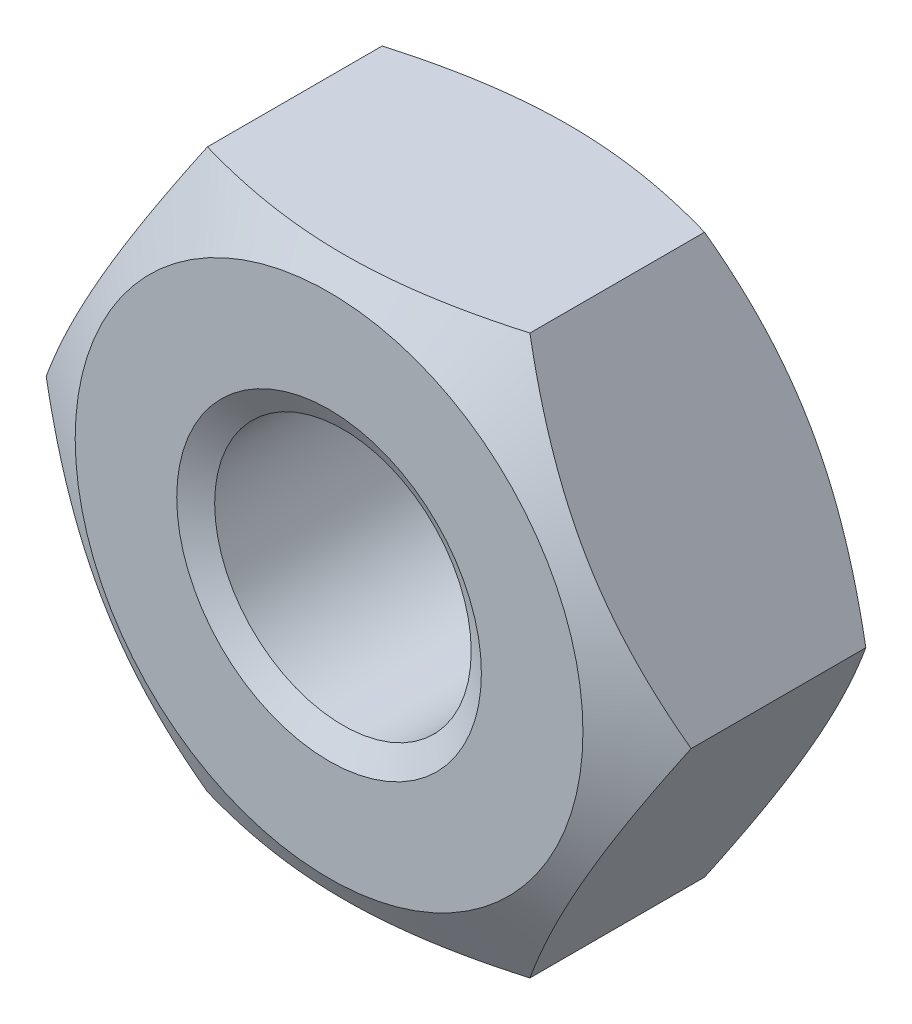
ISO-10303-21;
HEADER;
FILE_DESCRIPTION(('STEP AP214'),'2;1');
FILE_NAME('part.step','',(''),(''),'','','');
FILE_SCHEMA(('AUTOMOTIVE_DESIGN { 1 0 10303 214 1 1 1 1 }'));
ENDSEC;
DATA;
#1=APPLICATION_CONTEXT('core data for automotive mechanical design processes');
#2=APPLICATION_PROTOCOL_DEFINITION('international standard','automotive_design',2000,#1);
#3=PRODUCT_CONTEXT('',#1,'mechanical');
#4=PRODUCT('Part','Part','',(#3));
#5=PRODUCT_RELATED_PRODUCT_CATEGORY('part','',(#4));
#6=PRODUCT_DEFINITION_FORMATION('','',#4);
#7=PRODUCT_DEFINITION_CONTEXT('part definition',#1,'design');
#8=PRODUCT_DEFINITION('design','',#6,#7);
#9=PRODUCT_DEFINITION_SHAPE('','',#8);
#10=(LENGTH_UNIT() NAMED_UNIT(*) SI_UNIT(.MILLI.,.METRE.));
#11=(NAMED_UNIT(*) PLANE_ANGLE_UNIT() SI_UNIT($,.RADIAN.));
#12=(NAMED_UNIT(*) SI_UNIT($,.STERADIAN.) SOLID_ANGLE_UNIT());
#13=UNCERTAINTY_MEASURE_WITH_UNIT(LENGTH_MEASURE(1.E-05),#10,'distance_accuracy_value','');
#14=(GEOMETRIC_REPRESENTATION_CONTEXT(3) GLOBAL_UNCERTAINTY_ASSIGNED_CONTEXT((#13)) GLOBAL_UNIT_ASSIGNED_CONTEXT((#10,
#11,#12)) REPRESENTATION_CONTEXT('',''));
#15=CARTESIAN_POINT('',(0.,0.,0.));
#16=DIRECTION('',(0.,0.,1.));
#17=DIRECTION('',(1.,0.,0.));
#18=AXIS2_PLACEMENT_3D('',#15,#16,#17);
#19=CARTESIAN_POINT('',(0.,0.,0.273429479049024));
#20=DIRECTION('',(0.,0.,-1.));
#21=DIRECTION('',(1.,0.,0.));
#22=AXIS2_PLACEMENT_3D('',#19,#20,#21);
#23=CONICAL_SURFACE('',#22,5.52640625,1.0471975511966);
#24=CARTESIAN_POINT('',(0.,0.,0.546858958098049));
#25=DIRECTION('',(0.,0.,1.));
#26=DIRECTION('',(1.,0.,0.));
#27=AXIS2_PLACEMENT_3D('',#24,#25,#26);
#28=CIRCLE('',#27,5.0528125);
#29=CARTESIAN_POINT('',(5.0528125,0.,0.546858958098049));
#30=VERTEX_POINT('',#29);
#31=EDGE_CURVE('E11',#30,#30,#28,.T.);
#32=ORIENTED_EDGE('',*,*,#31,.T.);
#33=EDGE_LOOP('',(#32));
#34=FACE_BOUND('',#33,.T.);
#35=CARTESIAN_POINT('',(0.,0.,0.));
#36=DIRECTION('',(0.,0.,1.));
#37=DIRECTION('',(1.,0.,0.));
#38=AXIS2_PLACEMENT_3D('',#35,#36,#37);
#39=CIRCLE('',#38,6.);
#40=CARTESIAN_POINT('',(6.,0.,0.));
#41=VERTEX_POINT('',#40);
#42=EDGE_CURVE('E98',#41,#41,#39,.T.);
#43=ORIENTED_EDGE('',*,*,#42,.F.);
#44=EDGE_LOOP('',(#43));
#45=FACE_BOUND('',#44,.T.);
#46=ADVANCED_FACE('F16',(#34,#45),#23,.F.);
#47=CARTESIAN_POINT('',(0.,0.,5.));
#48=DIRECTION('',(0.,0.,-1.));
#49=DIRECTION('',(1.,0.,0.));
#50=AXIS2_PLACEMENT_3D('',#47,#48,#49);
#51=CYLINDRICAL_SURFACE('',#50,5.0528125);
#52=CARTESIAN_POINT('',(0.,0.,9.45314104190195));
#53=DIRECTION('',(0.,0.,1.));
#54=DIRECTION('',(1.,0.,0.));
#55=AXIS2_PLACEMENT_3D('',#52,#53,#54);
#56=CIRCLE('',#55,5.0528125);
#57=CARTESIAN_POINT('',(5.0528125,0.,9.45314104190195));
#58=VERTEX_POINT('',#57);
#59=EDGE_CURVE('E20',#58,#58,#56,.T.);
#60=ORIENTED_EDGE('',*,*,#59,.T.);
#61=EDGE_LOOP('',(#60));
#62=FACE_BOUND('',#61,.T.);
#63=ORIENTED_EDGE('',*,*,#31,.F.);
#64=EDGE_LOOP('',(#63));
#65=FACE_BOUND('',#64,.T.);
#66=ADVANCED_FACE('F234',(#62,#65),#51,.F.);
#67=CARTESIAN_POINT('',(0.,0.,9.72657052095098));
#68=DIRECTION('',(0.,0.,1.));
#69=DIRECTION('',(1.,0.,0.));
#70=AXIS2_PLACEMENT_3D('',#67,#68,#69);
#71=CONICAL_SURFACE('',#70,5.52640625,1.0471975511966);
#72=CARTESIAN_POINT('',(0.,0.,10.));
#73=DIRECTION('',(0.,0.,-1.));
#74=DIRECTION('',(1.,0.,0.));
#75=AXIS2_PLACEMENT_3D('',#72,#73,#74);
#76=CIRCLE('',#75,6.);
#77=CARTESIAN_POINT('',(6.,0.,10.));
#78=VERTEX_POINT('',#77);
#79=EDGE_CURVE('E137',#78,#78,#76,.T.);
#80=ORIENTED_EDGE('',*,*,#79,.F.);
#81=EDGE_LOOP('',(#80));
#82=FACE_BOUND('',#81,.T.);
#83=ORIENTED_EDGE('',*,*,#59,.F.);
#84=EDGE_LOOP('',(#83));
#85=FACE_BOUND('',#84,.T.);
#86=ADVANCED_FACE('F240',(#82,#85),#71,.F.);
#87=CARTESIAN_POINT('',(0.,0.,0.779915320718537));
#88=DIRECTION('',(0.,0.,1.));
#89=DIRECTION('',(1.,0.,0.));
#90=AXIS2_PLACEMENT_3D('',#87,#88,#89);
#91=CONICAL_SURFACE('',#90,11.3508529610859,1.0471975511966);
#92=CARTESIAN_POINT('',(12.7017059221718,0.,1.55983064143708));
#93=CARTESIAN_POINT('',(9.52627944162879,-5.5,-0.273502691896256));
#94=CARTESIAN_POINT('',(6.35085296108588,-11.,1.55983064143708));
#95=(BOUNDED_CURVE() B_SPLINE_CURVE(2,(#92,#93,#94),.UNSPECIFIED.,.F.,
.F.) B_SPLINE_CURVE_WITH_KNOTS((3,3),(0.,12.8527975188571),
.UNSPECIFIED.) CURVE() GEOMETRIC_REPRESENTATION_ITEM() RATIONAL_B_SPLINE_CURVE((1.,
1.15470053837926,1.)) REPRESENTATION_ITEM(''));
#96=CARTESIAN_POINT('',(12.7017059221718,0.,1.55983064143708));
#97=VERTEX_POINT('',#96);
#98=CARTESIAN_POINT('',(6.35085296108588,-11.,1.55983064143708));
#99=VERTEX_POINT('',#98);
#100=EDGE_CURVE('E117',#97,#99,#95,.T.);
#101=ORIENTED_EDGE('',*,*,#100,.T.);
#102=CARTESIAN_POINT('',(6.35085296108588,-11.,1.55983064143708));
#103=CARTESIAN_POINT('',(0.,-11.,-0.273502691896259));
#104=CARTESIAN_POINT('',(-6.35085296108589,-11.,1.55983064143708));
#105=(BOUNDED_CURVE() B_SPLINE_CURVE(2,(#102,#103,#104),.UNSPECIFIED.,.F.,
.F.) B_SPLINE_CURVE_WITH_KNOTS((3,3),(0.,12.8527975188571),
.UNSPECIFIED.) CURVE() GEOMETRIC_REPRESENTATION_ITEM() RATIONAL_B_SPLINE_CURVE((1.,
1.15470053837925,1.)) REPRESENTATION_ITEM(''));
#106=CARTESIAN_POINT('',(-6.35085296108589,-11.,1.55983064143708));
#107=VERTEX_POINT('',#106);
#108=EDGE_CURVE('E109',#99,#107,#105,.T.);
#109=ORIENTED_EDGE('',*,*,#108,.T.);
#110=CARTESIAN_POINT('',(-6.35085296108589,-11.,1.55983064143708));
#111=CARTESIAN_POINT('',(-9.52627944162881,-5.49999999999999,-0.273502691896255));
#112=CARTESIAN_POINT('',(-12.7017059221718,0.,1.55983064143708));
#113=(BOUNDED_CURVE() B_SPLINE_CURVE(2,(#110,#111,#112),.UNSPECIFIED.,.F.,
.F.) B_SPLINE_CURVE_WITH_KNOTS((3,3),(0.,12.8527975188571),
.UNSPECIFIED.) CURVE() GEOMETRIC_REPRESENTATION_ITEM() RATIONAL_B_SPLINE_CURVE((1.,
1.15470053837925,1.)) REPRESENTATION_ITEM(''));
#114=CARTESIAN_POINT('',(-12.7017059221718,0.,1.55983064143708));
#115=VERTEX_POINT('',#114);
#116=EDGE_CURVE('E108',#107,#115,#113,.T.);
#117=ORIENTED_EDGE('',*,*,#116,.T.);
#118=CARTESIAN_POINT('',(-12.7017059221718,0.,1.55983064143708));
#119=CARTESIAN_POINT('',(-9.52627944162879,5.5,-0.273502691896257));
#120=CARTESIAN_POINT('',(-6.35085296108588,11.,1.55983064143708));
#121=(BOUNDED_CURVE() B_SPLINE_CURVE(2,(#118,#119,#120),.UNSPECIFIED.,.F.,
.F.) B_SPLINE_CURVE_WITH_KNOTS((3,3),(0.,12.8527975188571),
.UNSPECIFIED.) CURVE() GEOMETRIC_REPRESENTATION_ITEM() RATIONAL_B_SPLINE_CURVE((1.,
1.15470053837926,1.)) REPRESENTATION_ITEM(''));
#122=CARTESIAN_POINT('',(-6.35085296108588,11.,1.55983064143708));
#123=VERTEX_POINT('',#122);
#124=EDGE_CURVE('E103',#115,#123,#121,.T.);
#125=ORIENTED_EDGE('',*,*,#124,.T.);
#126=CARTESIAN_POINT('',(-6.35085296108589,11.,1.55983064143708));
#127=CARTESIAN_POINT('',(0.,11.,-0.27350269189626));
#128=CARTESIAN_POINT('',(6.35085296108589,11.,1.55983064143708));
#129=(BOUNDED_CURVE() B_SPLINE_CURVE(2,(#126,#127,#128),.UNSPECIFIED.,.F.,
.F.) B_SPLINE_CURVE_WITH_KNOTS((3,3),(0.,12.8527975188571),
.UNSPECIFIED.) CURVE() GEOMETRIC_REPRESENTATION_ITEM() RATIONAL_B_SPLINE_CURVE((1.,
1.15470053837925,1.)) REPRESENTATION_ITEM(''));
#130=CARTESIAN_POINT('',(6.35085296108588,11.,1.55983064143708));
#131=VERTEX_POINT('',#130);
#132=EDGE_CURVE('E85',#123,#131,#129,.T.);
#133=ORIENTED_EDGE('',*,*,#132,.T.);
#134=CARTESIAN_POINT('',(6.35085296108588,11.,1.55983064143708));
#135=CARTESIAN_POINT('',(9.52627944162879,5.5,-0.273502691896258));
#136=CARTESIAN_POINT('',(12.7017059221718,0.,1.55983064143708));
#137=(BOUNDED_CURVE() B_SPLINE_CURVE(2,(#134,#135,#136),.UNSPECIFIED.,.F.,
.F.) B_SPLINE_CURVE_WITH_KNOTS((3,3),(0.,12.8527975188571),
.UNSPECIFIED.) CURVE() GEOMETRIC_REPRESENTATION_ITEM() RATIONAL_B_SPLINE_CURVE((1.,
1.15470053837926,1.)) REPRESENTATION_ITEM(''));
#138=EDGE_CURVE('E82',#131,#97,#137,.T.);
#139=ORIENTED_EDGE('',*,*,#138,.T.);
#140=EDGE_LOOP('',(#101,#109,#117,#125,#133,#139));
#141=FACE_BOUND('',#140,.T.);
#142=CARTESIAN_POINT('',(0.,0.,0.));
#143=DIRECTION('',(0.,0.,1.));
#144=DIRECTION('',(1.,0.,0.));
#145=AXIS2_PLACEMENT_3D('',#142,#143,#144);
#146=CIRCLE('',#145,10.);
#147=CARTESIAN_POINT('',(10.,0.,0.));
#148=VERTEX_POINT('',#147);
#149=EDGE_CURVE('E80',#148,#148,#146,.T.);
#150=ORIENTED_EDGE('',*,*,#149,.T.);
#151=EDGE_LOOP('',(#150));
#152=FACE_BOUND('',#151,.T.);
#153=ADVANCED_FACE('F188',(#141,#152),#91,.T.);
#154=CARTESIAN_POINT('',(0.,0.,9.22008467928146));
#155=DIRECTION('',(0.,0.,-1.));
#156=DIRECTION('',(1.,0.,0.));
#157=AXIS2_PLACEMENT_3D('',#154,#155,#156);
#158=CONICAL_SURFACE('',#157,11.3508529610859,1.0471975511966);
#159=CARTESIAN_POINT('',(6.35085296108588,-11.,8.44016935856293));
#160=CARTESIAN_POINT('',(9.52627944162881,-5.5,10.2735026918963));
#161=CARTESIAN_POINT('',(12.7017059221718,0.,8.44016935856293));
#162=(BOUNDED_CURVE() B_SPLINE_CURVE(2,(#159,#160,#161),.UNSPECIFIED.,.F.,
.F.) B_SPLINE_CURVE_WITH_KNOTS((3,3),(0.,12.8527975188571),
.UNSPECIFIED.) CURVE() GEOMETRIC_REPRESENTATION_ITEM() RATIONAL_B_SPLINE_CURVE((1.,
1.15470053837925,1.)) REPRESENTATION_ITEM(''));
#163=CARTESIAN_POINT('',(6.35085296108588,-11.,8.44016935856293));
#164=VERTEX_POINT('',#163);
#165=CARTESIAN_POINT('',(12.7017059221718,0.,8.44016935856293));
#166=VERTEX_POINT('',#165);
#167=EDGE_CURVE('E83',#164,#166,#162,.T.);
#168=ORIENTED_EDGE('',*,*,#167,.T.);
#169=CARTESIAN_POINT('',(12.7017059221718,0.,8.44016935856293));
#170=CARTESIAN_POINT('',(9.52627944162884,5.50000000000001,10.2735026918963));
#171=CARTESIAN_POINT('',(6.35085296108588,11.,8.44016935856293));
#172=(BOUNDED_CURVE() B_SPLINE_CURVE(2,(#169,#170,#171),.UNSPECIFIED.,.F.,
.F.) B_SPLINE_CURVE_WITH_KNOTS((3,3),(0.,12.8527975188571),
.UNSPECIFIED.) CURVE() GEOMETRIC_REPRESENTATION_ITEM() RATIONAL_B_SPLINE_CURVE((1.,
1.15470053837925,1.)) REPRESENTATION_ITEM(''));
#173=CARTESIAN_POINT('',(6.35085296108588,11.,8.44016935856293));
#174=VERTEX_POINT('',#173);
#175=EDGE_CURVE('E88',#166,#174,#172,.T.);
#176=ORIENTED_EDGE('',*,*,#175,.T.);
#177=CARTESIAN_POINT('',(6.35085296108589,11.,8.44016935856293));
#178=CARTESIAN_POINT('',(0.,11.,10.2735026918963));
#179=CARTESIAN_POINT('',(-6.35085296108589,11.,8.44016935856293));
#180=(BOUNDED_CURVE() B_SPLINE_CURVE(2,(#177,#178,#179),.UNSPECIFIED.,.F.,
.F.) B_SPLINE_CURVE_WITH_KNOTS((3,3),(0.,12.8527975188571),
.UNSPECIFIED.) CURVE() GEOMETRIC_REPRESENTATION_ITEM() RATIONAL_B_SPLINE_CURVE((1.,
1.15470053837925,1.)) REPRESENTATION_ITEM(''));
#181=CARTESIAN_POINT('',(-6.35085296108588,11.,8.44016935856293));
#182=VERTEX_POINT('',#181);
#183=EDGE_CURVE('E150',#174,#182,#180,.T.);
#184=ORIENTED_EDGE('',*,*,#183,.T.);
#185=CARTESIAN_POINT('',(-6.35085296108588,11.,8.44016935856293));
#186=CARTESIAN_POINT('',(-9.52627944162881,5.50000000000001,10.2735026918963));
#187=CARTESIAN_POINT('',(-12.7017059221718,0.,8.44016935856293));
#188=(BOUNDED_CURVE() B_SPLINE_CURVE(2,(#185,#186,#187),.UNSPECIFIED.,.F.,
.F.) B_SPLINE_CURVE_WITH_KNOTS((3,3),(0.,12.8527975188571),
.UNSPECIFIED.) CURVE() GEOMETRIC_REPRESENTATION_ITEM() RATIONAL_B_SPLINE_CURVE((1.,
1.15470053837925,1.)) REPRESENTATION_ITEM(''));
#189=CARTESIAN_POINT('',(-12.7017059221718,0.,8.44016935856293));
#190=VERTEX_POINT('',#189);
#191=EDGE_CURVE('E125',#182,#190,#188,.T.);
#192=ORIENTED_EDGE('',*,*,#191,.T.);
#193=CARTESIAN_POINT('',(-12.7017059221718,0.,8.44016935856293));
#194=CARTESIAN_POINT('',(-9.52627944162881,-5.49999999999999,10.2735026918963));
#195=CARTESIAN_POINT('',(-6.35085296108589,-11.,8.44016935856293));
#196=(BOUNDED_CURVE() B_SPLINE_CURVE(2,(#193,#194,#195),.UNSPECIFIED.,.F.,
.F.) B_SPLINE_CURVE_WITH_KNOTS((3,3),(0.,12.8527975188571),
.UNSPECIFIED.) CURVE() GEOMETRIC_REPRESENTATION_ITEM() RATIONAL_B_SPLINE_CURVE((1.,
1.15470053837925,1.)) REPRESENTATION_ITEM(''));
#197=CARTESIAN_POINT('',(-6.35085296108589,-11.,8.44016935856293));
#198=VERTEX_POINT('',#197);
#199=EDGE_CURVE('E118',#190,#198,#196,.T.);
#200=ORIENTED_EDGE('',*,*,#199,.T.);
#201=CARTESIAN_POINT('',(-6.35085296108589,-11.,8.44016935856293));
#202=CARTESIAN_POINT('',(0.,-11.,10.2735026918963));
#203=CARTESIAN_POINT('',(6.35085296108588,-11.,8.44016935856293));
#204=(BOUNDED_CURVE() B_SPLINE_CURVE(2,(#201,#202,#203),.UNSPECIFIED.,.F.,
.F.) B_SPLINE_CURVE_WITH_KNOTS((3,3),(0.,12.8527975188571),
.UNSPECIFIED.) CURVE() GEOMETRIC_REPRESENTATION_ITEM() RATIONAL_B_SPLINE_CURVE((1.,
1.15470053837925,1.)) REPRESENTATION_ITEM(''));
#205=EDGE_CURVE('E126',#198,#164,#204,.T.);
#206=ORIENTED_EDGE('',*,*,#205,.T.);
#207=EDGE_LOOP('',(#168,#176,#184,#192,#200,#206));
#208=FACE_BOUND('',#207,.T.);
#209=CARTESIAN_POINT('',(0.,0.,10.));
#210=DIRECTION('',(0.,0.,-1.));
#211=DIRECTION('',(1.,0.,0.));
#212=AXIS2_PLACEMENT_3D('',#209,#210,#211);
#213=CIRCLE('',#212,10.);
#214=CARTESIAN_POINT('',(10.,0.,10.));
#215=VERTEX_POINT('',#214);
#216=EDGE_CURVE('E92',#215,#215,#213,.T.);
#217=ORIENTED_EDGE('',*,*,#216,.T.);
#218=EDGE_LOOP('',(#217));
#219=FACE_BOUND('',#218,.T.);
#220=ADVANCED_FACE('F217',(#208,#219),#158,.T.);
#221=CARTESIAN_POINT('',(-9.52627944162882,5.5,0.));
#222=DIRECTION('',(-0.866025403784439,0.5,0.));
#223=DIRECTION('',(-0.5,-0.866025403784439,0.));
#224=AXIS2_PLACEMENT_3D('',#221,#222,#223);
#225=PLANE('',#224);
#226=ORIENTED_EDGE('',*,*,#191,.F.);
#227=DIRECTION('',(0.,0.,1.));
#228=VECTOR('',#227,1.);
#229=CARTESIAN_POINT('',(-6.35085296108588,11.,0.));
#230=LINE('',#229,#228);
#231=EDGE_CURVE('E102',#123,#182,#230,.T.);
#232=ORIENTED_EDGE('',*,*,#231,.F.);
#233=ORIENTED_EDGE('',*,*,#124,.F.);
#234=DIRECTION('',(0.,0.,1.));
#235=VECTOR('',#234,1.);
#236=CARTESIAN_POINT('',(-12.7017059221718,0.,0.));
#237=LINE('',#236,#235);
#238=EDGE_CURVE('E99',#115,#190,#237,.T.);
#239=ORIENTED_EDGE('',*,*,#238,.T.);
#240=EDGE_LOOP('',(#226,#232,#233,#239));
#241=FACE_BOUND('',#240,.T.);
#242=ADVANCED_FACE('F193',(#241),#225,.T.);
#243=CARTESIAN_POINT('',(0.,11.,0.));
#244=DIRECTION('',(0.,1.,0.));
#245=DIRECTION('',(-1.,0.,0.));
#246=AXIS2_PLACEMENT_3D('',#243,#244,#245);
#247=PLANE('',#246);
#248=ORIENTED_EDGE('',*,*,#183,.F.);
#249=DIRECTION('',(0.,0.,1.));
#250=VECTOR('',#249,1.);
#251=CARTESIAN_POINT('',(6.35085296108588,11.,0.));
#252=LINE('',#251,#250);
#253=EDGE_CURVE('E97',#131,#174,#252,.T.);
#254=ORIENTED_EDGE('',*,*,#253,.F.);
#255=ORIENTED_EDGE('',*,*,#132,.F.);
#256=ORIENTED_EDGE('',*,*,#231,.T.);
#257=EDGE_LOOP('',(#248,#254,#255,#256));
#258=FACE_BOUND('',#257,.T.);
#259=ADVANCED_FACE('F245',(#258),#247,.T.);
#260=CARTESIAN_POINT('',(9.52627944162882,5.5,0.));
#261=DIRECTION('',(0.866025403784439,0.5,0.));
#262=DIRECTION('',(-0.5,0.866025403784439,0.));
#263=AXIS2_PLACEMENT_3D('',#260,#261,#262);
#264=PLANE('',#263);
#265=ORIENTED_EDGE('',*,*,#175,.F.);
#266=DIRECTION('',(0.,0.,1.));
#267=VECTOR('',#266,1.);
#268=CARTESIAN_POINT('',(12.7017059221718,0.,0.));
#269=LINE('',#268,#267);
#270=EDGE_CURVE('E94',#97,#166,#269,.T.);
#271=ORIENTED_EDGE('',*,*,#270,.F.);
#272=ORIENTED_EDGE('',*,*,#138,.F.);
#273=ORIENTED_EDGE('',*,*,#253,.T.);
#274=EDGE_LOOP('',(#265,#271,#272,#273));
#275=FACE_BOUND('',#274,.T.);
#276=ADVANCED_FACE('F247',(#275),#264,.T.);
#277=CARTESIAN_POINT('',(9.52627944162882,-5.5,0.));
#278=DIRECTION('',(0.866025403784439,-0.5,0.));
#279=DIRECTION('',(0.5,0.866025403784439,0.));
#280=AXIS2_PLACEMENT_3D('',#277,#278,#279);
#281=PLANE('',#280);
#282=ORIENTED_EDGE('',*,*,#167,.F.);
#283=DIRECTION('',(0.,0.,1.));
#284=VECTOR('',#283,1.);
#285=CARTESIAN_POINT('',(6.35085296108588,-11.,0.));
#286=LINE('',#285,#284);
#287=EDGE_CURVE('E135',#99,#164,#286,.T.);
#288=ORIENTED_EDGE('',*,*,#287,.F.);
#289=ORIENTED_EDGE('',*,*,#100,.F.);
#290=ORIENTED_EDGE('',*,*,#270,.T.);
#291=EDGE_LOOP('',(#282,#288,#289,#290));
#292=FACE_BOUND('',#291,.T.);
#293=ADVANCED_FACE('F230',(#292),#281,.T.);
#294=CARTESIAN_POINT('',(0.,0.,0.));
#295=DIRECTION('',(0.,0.,1.));
#296=DIRECTION('',(0.,-1.,0.));
#297=AXIS2_PLACEMENT_3D('',#294,#295,#296);
#298=PLANE('',#297);
#299=ORIENTED_EDGE('',*,*,#42,.T.);
#300=EDGE_LOOP('',(#299));
#301=FACE_BOUND('',#300,.T.);
#302=ORIENTED_EDGE('',*,*,#149,.F.);
#303=EDGE_LOOP('',(#302));
#304=FACE_BOUND('',#303,.T.);
#305=ADVANCED_FACE('F18',(#301,#304),#298,.F.);
#306=CARTESIAN_POINT('',(0.,0.,10.));
#307=DIRECTION('',(0.,0.,1.));
#308=DIRECTION('',(0.,-1.,0.));
#309=AXIS2_PLACEMENT_3D('',#306,#307,#308);
#310=PLANE('',#309);
#311=ORIENTED_EDGE('',*,*,#79,.T.);
#312=EDGE_LOOP('',(#311));
#313=FACE_BOUND('',#312,.T.);
#314=ORIENTED_EDGE('',*,*,#216,.F.);
#315=EDGE_LOOP('',(#314));
#316=FACE_BOUND('',#315,.T.);
#317=ADVANCED_FACE('F219',(#313,#316),#310,.T.);
#318=CARTESIAN_POINT('',(0.,-11.,0.));
#319=DIRECTION('',(0.,-1.,0.));
#320=DIRECTION('',(1.,0.,0.));
#321=AXIS2_PLACEMENT_3D('',#318,#319,#320);
#322=PLANE('',#321);
#323=ORIENTED_EDGE('',*,*,#205,.F.);
#324=DIRECTION('',(0.,0.,1.));
#325=VECTOR('',#324,1.);
#326=CARTESIAN_POINT('',(-6.35085296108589,-11.,0.));
#327=LINE('',#326,#325);
#328=EDGE_CURVE('E138',#107,#198,#327,.T.);
#329=ORIENTED_EDGE('',*,*,#328,.F.);
#330=ORIENTED_EDGE('',*,*,#108,.F.);
#331=ORIENTED_EDGE('',*,*,#287,.T.);
#332=EDGE_LOOP('',(#323,#329,#330,#331));
#333=FACE_BOUND('',#332,.T.);
#334=ADVANCED_FACE('F221',(#333),#322,.T.);
#335=CARTESIAN_POINT('',(-9.52627944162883,-5.5,0.));
#336=DIRECTION('',(-0.866025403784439,-0.5,0.));
#337=DIRECTION('',(0.5,-0.866025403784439,0.));
#338=AXIS2_PLACEMENT_3D('',#335,#336,#337);
#339=PLANE('',#338);
#340=ORIENTED_EDGE('',*,*,#199,.F.);
#341=ORIENTED_EDGE('',*,*,#238,.F.);
#342=ORIENTED_EDGE('',*,*,#116,.F.);
#343=ORIENTED_EDGE('',*,*,#328,.T.);
#344=EDGE_LOOP('',(#340,#341,#342,#343));
#345=FACE_BOUND('',#344,.T.);
#346=ADVANCED_FACE('F191',(#345),#339,.T.);
#347=CLOSED_SHELL('',(#46,#66,#86,#153,#220,#242,#259,#276,#293,#305,#317,#334,#346));
#348=MANIFOLD_SOLID_BREP('B1',#347);
#349=ADVANCED_BREP_SHAPE_REPRESENTATION('',(#18,#348),#14);
#350=SHAPE_DEFINITION_REPRESENTATION(#9,#349);
ENDSEC;
END-ISO-10303-21;
